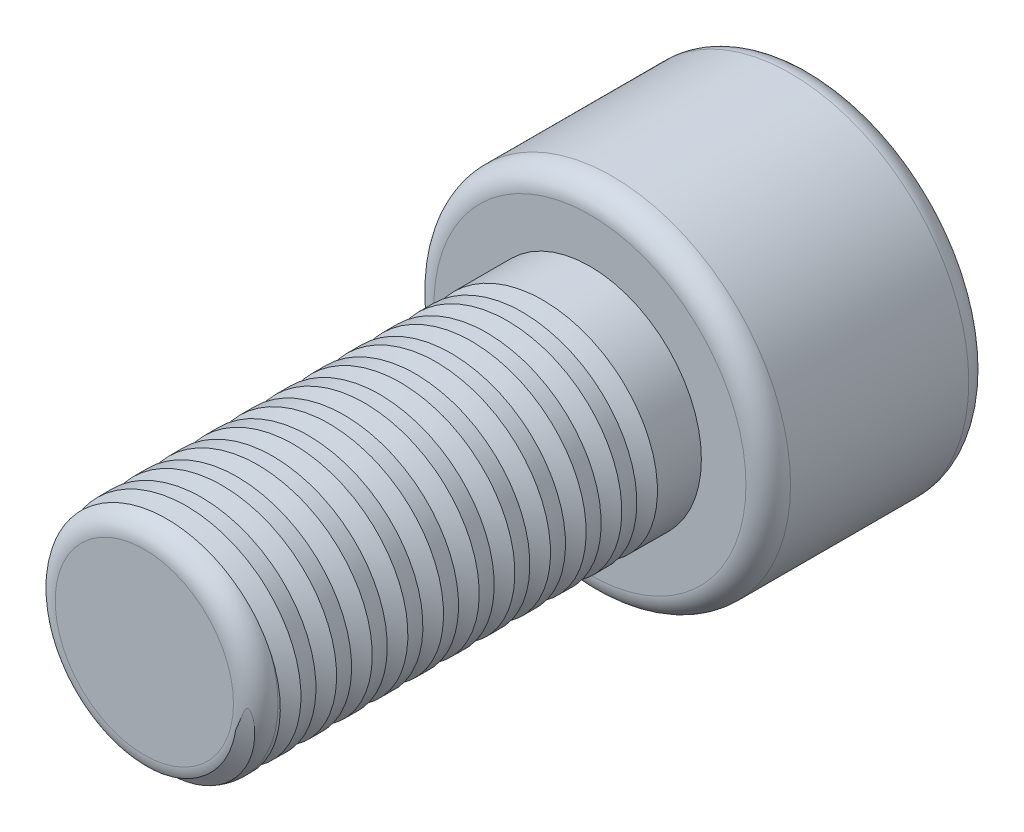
from build123d import *

# Parameters (mm, degrees)
SKETCH_1_R          = 4
EXTRUDE_1_DEPTH     = 5
SKETCH_2_R          = 2.5
EXTRUDE_2_DEPTH     = 10
FILLET_1_R          = 0.5
SWEEP_2_PITCH       = 0.8
SWEEP_2_HEIGHT      = 9.5
SWEEP_2_RADIUS      = 2.1
SWEEP_2_START_ANGLE = 90
CUT_EXTRUDE_1_DEPTH = 3
FILLET_2_R          = 0.5


with BuildPart() as part:
    # Sketch 1 → Extrude 1 (new body)
    with BuildSketch(Plane.XY):
        Circle(SKETCH_1_R)
    extrude(amount=EXTRUDE_1_DEPTH)

    # Sketch 2 → Extrude 2 (add)
    with BuildSketch(Plane.XY.offset(5)):
        Circle(SKETCH_2_R)
    extrude(amount=EXTRUDE_2_DEPTH)

    # Fillet 1
    fillet_1_edges = [part.edges().sort_by_distance(p)[0] for p in [
        (-2.5, 0, 15),
    ]]
    fillet(fillet_1_edges, radius=FILLET_1_R)

    # Sweep 2: sweep along a helix
    with BuildLine() as sweep_2_path:
        add(Helix(SWEEP_2_PITCH, SWEEP_2_HEIGHT, SWEEP_2_RADIUS, center=(0, 0, 15), direction=(0, 0, -1), mode=Mode.PRIVATE).rotate(Axis((0, 0, 15), (0, 0, -1)), SWEEP_2_START_ANGLE))
    # Sketch 5 → Sweep 2 (sweep, cut)
    with BuildSketch(Plane(origin=(0, 0, 0), x_dir=(1, 0, 0), z_dir=(0, 1, 0))):
        Polygon((2.098661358, -15.020448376), (3.128370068, -15.614950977), (3.128370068, -14.425945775), align=None)
    sweep(path=sweep_2_path.line, is_frenet=True, mode=Mode.SUBTRACT)

    # Sketch 6 → Cut-Extrude 1 (cut)
    with BuildSketch(Plane(origin=(0, 0, 0), x_dir=(-1, 0, 0), z_dir=(0, 0, -1))):
        Polygon((1.906348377, -1.303521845), (2.08205722, 0.9991852), (0.175708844, 2.302707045), (-1.906348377, 1.303521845), (-2.08205722, -0.9991852), (-0.175708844, -2.302707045), align=None)
    extrude(amount=-CUT_EXTRUDE_1_DEPTH, mode=Mode.SUBTRACT)

    # Fillet 2
    fillet_2_edges = [part.edges().sort_by_distance(p)[0] for p in [
        (-4, 0, 0),
        (-4, 0, 5),
    ]]
    fillet(fillet_2_edges, radius=FILLET_2_R)


solid = part.part
